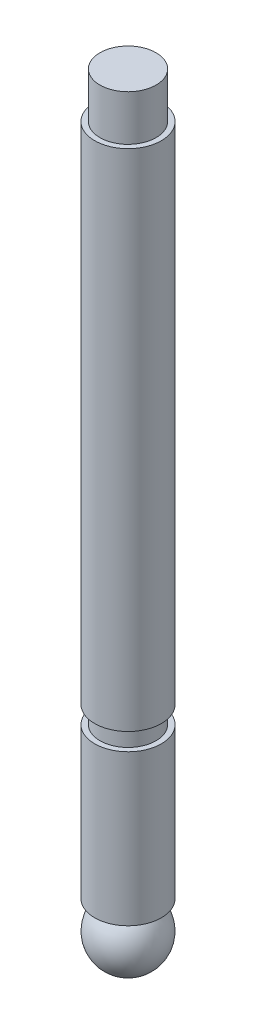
from build123d import *


with BuildPart() as part:
    # Sketch1 → Revolve2 (revolve)
    with BuildSketch(Plane.XY, mode=Mode.PRIVATE) as revolve2_sk:
        with BuildLine():
            Line((9.5, 0), (9.5, 43))
            Line((9.5, 43), (8, 43))
            Line((8, 43), (8, 48))
            Line((8, 48), (9.5, 48))
            Line((9.5, 48), (9.5, 192))
            Line((9.5, 192), (8, 192))
            Line((8, 192), (8, 205))
            Line((8, 205), (0, 205))
            Line((0, 205), (0, -17.5))
            ThreePointArc((0, -17.5), (9.117291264, -10.669269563), (5.123475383, 0))
            Line((5.123475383, 0), (9.5, 0))
        make_face()
    revolve(revolve2_sk.sketch.rotate(Axis((0, 0, 0), (0, 1, 0)), 90), axis=Axis((0, 0, 0), (0, 1, 0)))


solid = part.part
